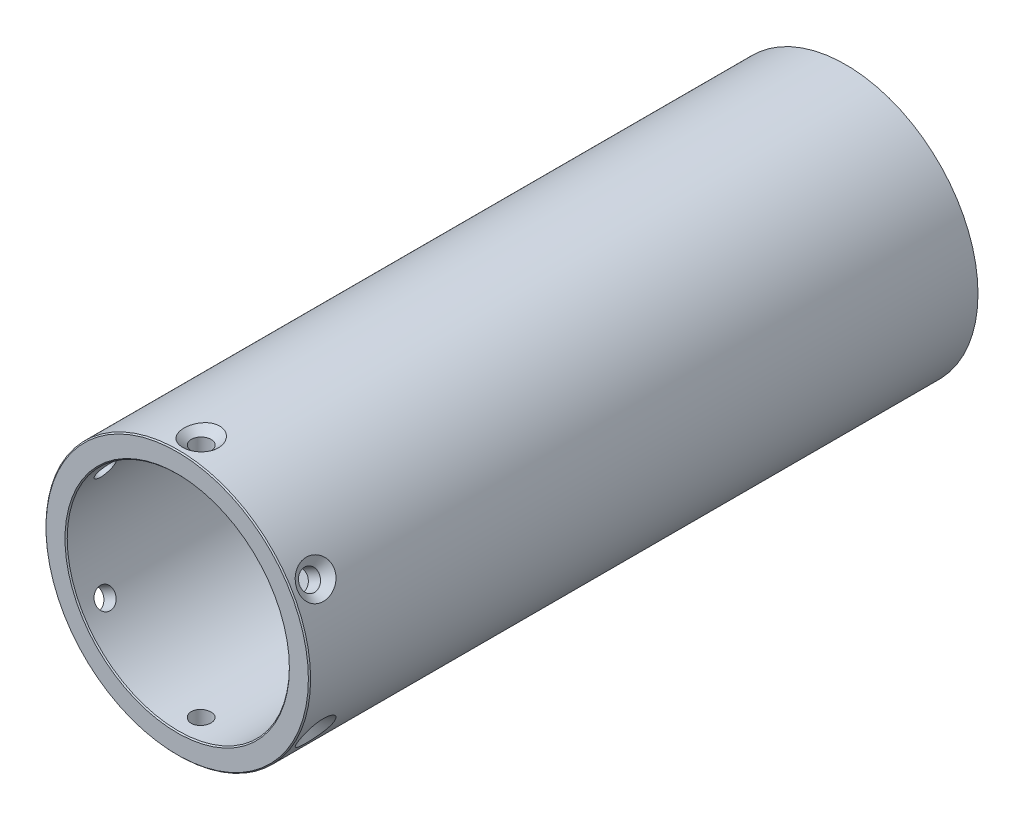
from build123d import *

# Parameters (mm, degrees)
BOSS_EXTRUDE1_DEPTH      = 76.2
BOSS_EXTRUDE1_DEPTH_BACK = 76.2
SKETCH3_R                = 30.1625
SKETCH3_R_2              = 24.2951
CUT_EXTRUDE1_REACH       = 160.257
SKETCH4_R                = 25.3238
CIRPATTERN1_COUNT        = 6
CHAMFER1_SIZE            = 0.254


with BuildPart() as part:
    # Sketch3 → Boss-Extrude1 (new, two sides: drawn at the far end of the back side and taken through both)
    with BuildSketch(Plane.XY.offset(-BOSS_EXTRUDE1_DEPTH_BACK)):
        Circle(SKETCH3_R)
        Circle(SKETCH3_R_2, mode=Mode.SUBTRACT)
    extrude(amount=BOSS_EXTRUDE1_DEPTH + BOSS_EXTRUDE1_DEPTH_BACK)

    # Sketch4 → Cut-Extrude1 (cut, up to next)
    with BuildSketch(Plane.XY.offset(76.2), mode=Mode.PRIVATE) as cut_extrude1_sk1:
        Circle(SKETCH4_R)
    cut_extrude1_tool1 = extrude(cut_extrude1_sk1.sketch, amount=-CUT_EXTRUDE1_REACH, mode=Mode.PRIVATE) & part.part
    add(cut_extrude1_tool1.solids().sort_by_distance((0, 0, 76.2))[0], mode=Mode.SUBTRACT)

    # Sketch7 → CSK for _8 Flat Head Machine Screw _100 (revolve, cut)
    with BuildSketch(Plane(origin=(0, 30.1625, 70.73015064), x_dir=(0, 0, 1), z_dir=(1, 0, 0))):
        Polygon((0, 0), (0, 18.444874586), (2.2479, 17.0942), (2.2479, 1.651767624), (4.2164, 0), align=None)
    csk_for_8_flat_head_machine_screw_100 = revolve(axis=Axis((0, 36.5125, 70.73015064), (0, -1, 0)), mode=Mode.SUBTRACT)

    # CirPattern1: CSK for _8 Flat Head Machine Screw _100 ×6 about axis
    cirpattern1_axis = Axis((0, 0, 76.2), (0, 0, -1))
    for i in range(1, CIRPATTERN1_COUNT):
        add(csk_for_8_flat_head_machine_screw_100.rotate(cirpattern1_axis, i * 360 / CIRPATTERN1_COUNT), mode=Mode.SUBTRACT)

    # Chamfer1
    chamfer1_edges = [part.edges().sort_by_distance(p)[0] for p in [
        (-25.3238, 0, 76.2),
        (-30.1625, 0, 76.2),
    ]]
    chamfer(chamfer1_edges, length=CHAMFER1_SIZE)


solid = part.part
